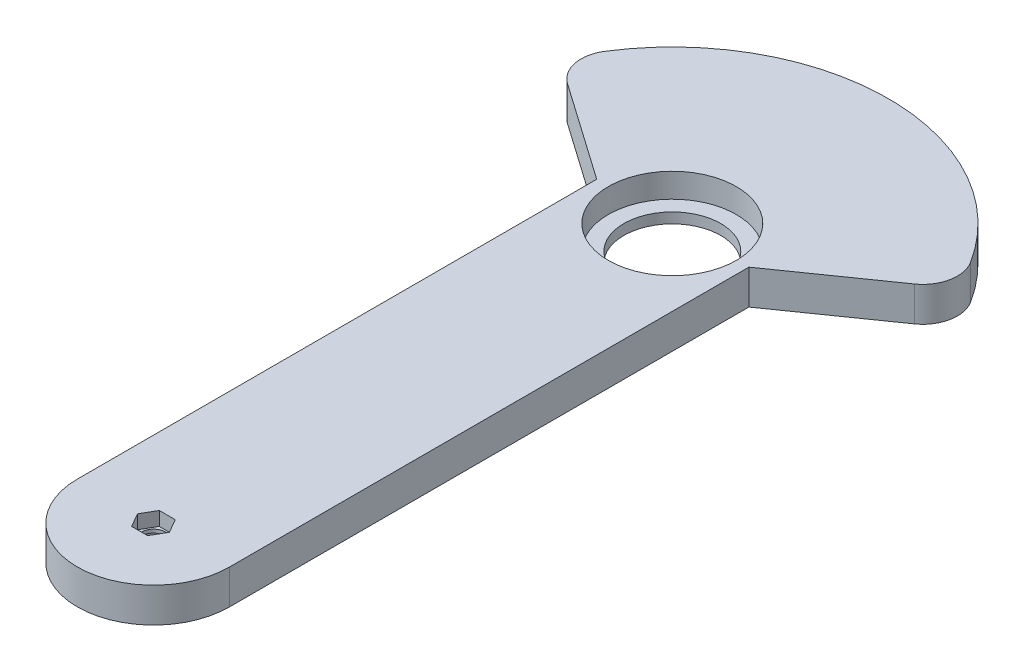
from build123d import *

# Parameters (mm, degrees)
BOSS_EXTRUDE1_DEPTH = 10
BOSS_EXTRUDE2_DEPTH = 10
SKETCH3_R           = 18.5
CUT_EXTRUDE1_DEPTH  = 7
SKETCH4_R           = 14
CUT_EXTRUDE2_DEPTH  = 181.671916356
SKETCH5_R           = 3.5
CUT_EXTRUDE3_DEPTH  = 181.671916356
SKETCH6_R           = 8
CUT_EXTRUDE4_DEPTH  = 5
CUT_EXTRUDE5_DEPTH  = 4


with BuildPart() as part:
    # Sketch1 → Boss-Extrude1 (new body)
    with BuildSketch(Plane(origin=(0, 0, 0), x_dir=(1, 0, 0), z_dir=(0, 1, 0))):
        with BuildLine():
            Line((-50.126401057, 19.839201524), (-7.169705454, -10.239400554))
            ThreePointArc((-7.169705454, -10.239400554), (0, -12.5), (7.169705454, -10.239400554))
            Line((7.169705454, -10.239400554), (50.126401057, 19.839201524))
            ThreePointArc((50.126401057, 19.839201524), (54.194564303, 26.060188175), (52.845996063, 33.369907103))
            ThreePointArc((52.845996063, 33.369907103), (0, 62.5), (-52.845996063, 33.369907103))
            ThreePointArc((-52.845996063, 33.369907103), (-54.194564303, 26.060188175), (-50.126401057, 19.839201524))
        make_face()
    extrude(amount=BOSS_EXTRUDE1_DEPTH)

    # Sketch2 → Boss-Extrude2 (add)
    with BuildSketch(Plane(origin=(0, 0, 0), x_dir=(1, 0, 0), z_dir=(0, 1, 0))):
        with BuildLine():
            Line((-22, 0.144883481), (-22, -150))
            ThreePointArc((-22, -150), (0, -172), (22, -150))
            Line((22, -150), (22, 0.144883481))
            Line((22, 0.144883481), (7.169705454, -10.239400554))
            ThreePointArc((7.169705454, -10.239400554), (0, -12.5), (-7.169705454, -10.239400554))
            Line((-7.169705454, -10.239400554), (-22, 0.144883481))
        make_face()
    extrude(amount=BOSS_EXTRUDE2_DEPTH)

    # Sketch3 → Cut-Extrude1 (cut)
    with BuildSketch(Plane(origin=(0, 10, 0), x_dir=(1, 0, 0), z_dir=(0, 1, 0))):
        with Locations(Location((0, 0, 0), (0, 0, 270))):
            Circle(SKETCH3_R)
    extrude(amount=-CUT_EXTRUDE1_DEPTH, mode=Mode.SUBTRACT)

    # Sketch4 → Cut-Extrude2 (cut, through all)
    with BuildSketch(Plane(origin=(0, 10, 0), x_dir=(1, 0, 0), z_dir=(0, 1, 0))):
        with Locations(Location((0, 0, 0), (0, 0, 270))):
            Circle(SKETCH4_R)
    extrude(amount=-CUT_EXTRUDE2_DEPTH, mode=Mode.SUBTRACT)

    # Sketch5 → Cut-Extrude3 (cut, through all)
    with BuildSketch(Plane(origin=(0, 10, 0), x_dir=(1, 0, 0), z_dir=(0, 1, 0))):
        with Locations(Location((0, -150, 0), (0, 0, 270))):
            Circle(SKETCH5_R)
    extrude(amount=-CUT_EXTRUDE3_DEPTH, mode=Mode.SUBTRACT)

    # Sketch6 → Cut-Extrude4 (cut)
    with BuildSketch(Plane.XZ):
        with Locations(Location((0, 150, 0), (0, 0, 270))):
            Circle(SKETCH6_R)
    extrude(amount=-CUT_EXTRUDE4_DEPTH, mode=Mode.SUBTRACT)

    # Sketch7 → Cut-Extrude5 (cut)
    with BuildSketch(Plane(origin=(0, 10, 0), x_dir=(1, 0, 0), z_dir=(0, 1, 0))):
        Polygon((4.618802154, -150), (2.309401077, -146), (-2.309401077, -146), (-4.618802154, -150), (-2.309401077, -154), (2.309401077, -154), align=None)
    extrude(amount=-CUT_EXTRUDE5_DEPTH, mode=Mode.SUBTRACT)


solid = part.part
